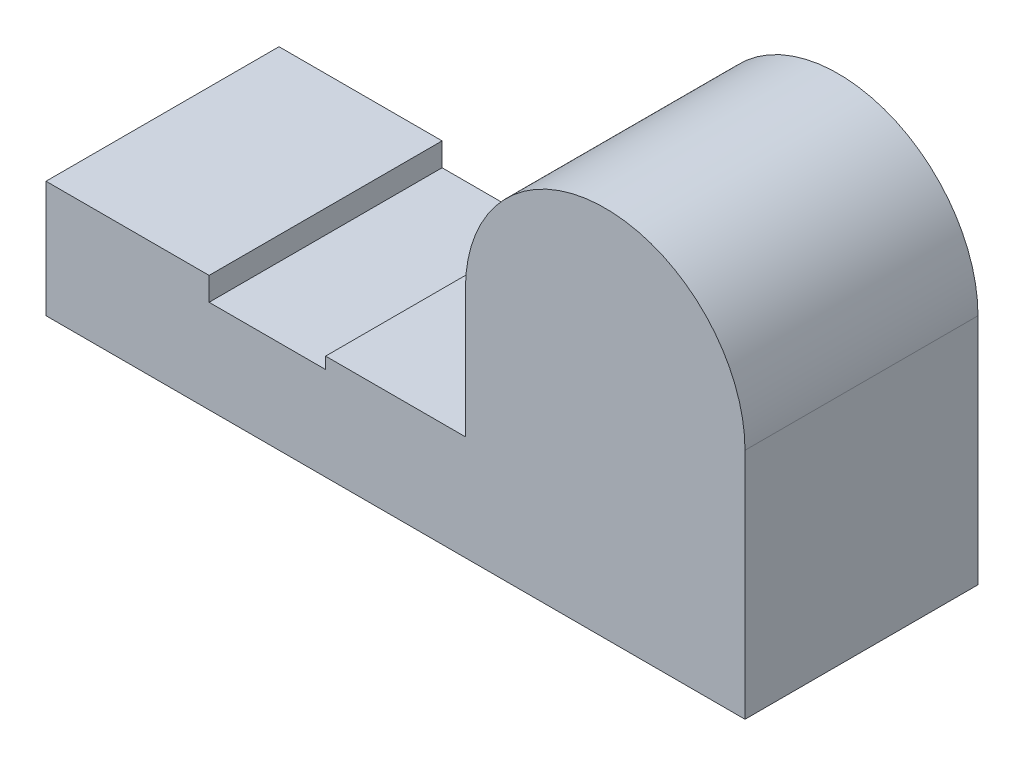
ISO-10303-21;
HEADER;
FILE_DESCRIPTION(('STEP AP214'),'2;1');
FILE_NAME('part.step','',(''),(''),'','','');
FILE_SCHEMA(('AUTOMOTIVE_DESIGN { 1 0 10303 214 1 1 1 1 }'));
ENDSEC;
DATA;
#1=APPLICATION_CONTEXT('core data for automotive mechanical design processes');
#2=APPLICATION_PROTOCOL_DEFINITION('international standard','automotive_design',2000,#1);
#3=PRODUCT_CONTEXT('',#1,'mechanical');
#4=PRODUCT('Part','Part','',(#3));
#5=PRODUCT_RELATED_PRODUCT_CATEGORY('part','',(#4));
#6=PRODUCT_DEFINITION_FORMATION('','',#4);
#7=PRODUCT_DEFINITION_CONTEXT('part definition',#1,'design');
#8=PRODUCT_DEFINITION('design','',#6,#7);
#9=PRODUCT_DEFINITION_SHAPE('','',#8);
#10=(LENGTH_UNIT() NAMED_UNIT(*) SI_UNIT(.MILLI.,.METRE.));
#11=(NAMED_UNIT(*) PLANE_ANGLE_UNIT() SI_UNIT($,.RADIAN.));
#12=(NAMED_UNIT(*) SI_UNIT($,.STERADIAN.) SOLID_ANGLE_UNIT());
#13=UNCERTAINTY_MEASURE_WITH_UNIT(LENGTH_MEASURE(1.E-05),#10,'distance_accuracy_value','');
#14=(GEOMETRIC_REPRESENTATION_CONTEXT(3) GLOBAL_UNCERTAINTY_ASSIGNED_CONTEXT((#13)) GLOBAL_UNIT_ASSIGNED_CONTEXT((#10,
#11,#12)) REPRESENTATION_CONTEXT('',''));
#15=CARTESIAN_POINT('',(0.,0.,0.));
#16=DIRECTION('',(0.,0.,1.));
#17=DIRECTION('',(1.,0.,0.));
#18=AXIS2_PLACEMENT_3D('',#15,#16,#17);
#19=CARTESIAN_POINT('',(160.,45.,100.));
#20=DIRECTION('',(1.,0.,0.));
#21=DIRECTION('',(0.,0.,-1.));
#22=AXIS2_PLACEMENT_3D('',#19,#20,#21);
#23=PLANE('',#22);
#24=DIRECTION('',(0.,-1.,0.));
#25=VECTOR('',#24,1.);
#26=CARTESIAN_POINT('',(160.,45.,0.));
#27=LINE('',#26,#25);
#28=CARTESIAN_POINT('',(160.,45.,0.));
#29=VERTEX_POINT('',#28);
#30=CARTESIAN_POINT('',(160.,40.,0.));
#31=VERTEX_POINT('',#30);
#32=EDGE_CURVE('E140',#29,#31,#27,.T.);
#33=ORIENTED_EDGE('',*,*,#32,.T.);
#34=DIRECTION('',(0.,0.,-1.));
#35=VECTOR('',#34,1.);
#36=CARTESIAN_POINT('',(160.,40.,100.));
#37=LINE('',#36,#35);
#38=CARTESIAN_POINT('',(160.,40.,100.));
#39=VERTEX_POINT('',#38);
#40=EDGE_CURVE('E11',#39,#31,#37,.T.);
#41=ORIENTED_EDGE('',*,*,#40,.F.);
#42=DIRECTION('',(0.,-1.,0.));
#43=VECTOR('',#42,1.);
#44=CARTESIAN_POINT('',(160.,45.,100.));
#45=LINE('',#44,#43);
#46=CARTESIAN_POINT('',(160.,45.,100.));
#47=VERTEX_POINT('',#46);
#48=EDGE_CURVE('E158',#47,#39,#45,.T.);
#49=ORIENTED_EDGE('',*,*,#48,.F.);
#50=DIRECTION('',(0.,0.,-1.));
#51=VECTOR('',#50,1.);
#52=CARTESIAN_POINT('',(160.,45.,100.));
#53=LINE('',#52,#51);
#54=EDGE_CURVE('E136',#47,#29,#53,.T.);
#55=ORIENTED_EDGE('',*,*,#54,.T.);
#56=EDGE_LOOP('',(#33,#41,#49,#55));
#57=FACE_BOUND('',#56,.T.);
#58=ADVANCED_FACE('F32',(#57),#23,.F.);
#59=CARTESIAN_POINT('',(160.,40.,100.));
#60=DIRECTION('',(0.,-1.,0.));
#61=DIRECTION('',(1.,0.,0.));
#62=AXIS2_PLACEMENT_3D('',#59,#60,#61);
#63=PLANE('',#62);
#64=DIRECTION('',(-1.,0.,0.));
#65=VECTOR('',#64,1.);
#66=CARTESIAN_POINT('',(160.,40.,0.));
#67=LINE('',#66,#65);
#68=CARTESIAN_POINT('',(110.,40.,0.));
#69=VERTEX_POINT('',#68);
#70=EDGE_CURVE('E143',#31,#69,#67,.T.);
#71=ORIENTED_EDGE('',*,*,#70,.T.);
#72=DIRECTION('',(0.,0.,-1.));
#73=VECTOR('',#72,1.);
#74=CARTESIAN_POINT('',(110.,40.,100.));
#75=LINE('',#74,#73);
#76=CARTESIAN_POINT('',(110.,40.,100.));
#77=VERTEX_POINT('',#76);
#78=EDGE_CURVE('E40',#77,#69,#75,.T.);
#79=ORIENTED_EDGE('',*,*,#78,.F.);
#80=DIRECTION('',(-1.,0.,0.));
#81=VECTOR('',#80,1.);
#82=CARTESIAN_POINT('',(160.,40.,100.));
#83=LINE('',#82,#81);
#84=EDGE_CURVE('E97',#39,#77,#83,.T.);
#85=ORIENTED_EDGE('',*,*,#84,.F.);
#86=ORIENTED_EDGE('',*,*,#40,.T.);
#87=EDGE_LOOP('',(#71,#79,#85,#86));
#88=FACE_BOUND('',#87,.T.);
#89=ADVANCED_FACE('F207',(#88),#63,.F.);
#90=CARTESIAN_POINT('',(110.,40.,100.));
#91=DIRECTION('',(-1.,0.,0.));
#92=DIRECTION('',(0.,0.,1.));
#93=AXIS2_PLACEMENT_3D('',#90,#91,#92);
#94=PLANE('',#93);
#95=DIRECTION('',(0.,1.,0.));
#96=VECTOR('',#95,1.);
#97=CARTESIAN_POINT('',(110.,40.,0.));
#98=LINE('',#97,#96);
#99=CARTESIAN_POINT('',(110.,50.,0.));
#100=VERTEX_POINT('',#99);
#101=EDGE_CURVE('E145',#69,#100,#98,.T.);
#102=ORIENTED_EDGE('',*,*,#101,.T.);
#103=DIRECTION('',(0.,0.,-1.));
#104=VECTOR('',#103,1.);
#105=CARTESIAN_POINT('',(110.,50.,100.));
#106=LINE('',#105,#104);
#107=CARTESIAN_POINT('',(110.,50.,100.));
#108=VERTEX_POINT('',#107);
#109=EDGE_CURVE('E171',#108,#100,#106,.T.);
#110=ORIENTED_EDGE('',*,*,#109,.F.);
#111=DIRECTION('',(0.,1.,0.));
#112=VECTOR('',#111,1.);
#113=CARTESIAN_POINT('',(110.,40.,100.));
#114=LINE('',#113,#112);
#115=EDGE_CURVE('E179',#77,#108,#114,.T.);
#116=ORIENTED_EDGE('',*,*,#115,.F.);
#117=ORIENTED_EDGE('',*,*,#78,.T.);
#118=EDGE_LOOP('',(#102,#110,#116,#117));
#119=FACE_BOUND('',#118,.T.);
#120=ADVANCED_FACE('F177',(#119),#94,.F.);
#121=CARTESIAN_POINT('',(110.,50.,100.));
#122=DIRECTION('',(0.,-1.,0.));
#123=DIRECTION('',(0.,0.,-1.));
#124=AXIS2_PLACEMENT_3D('',#121,#122,#123);
#125=PLANE('',#124);
#126=DIRECTION('',(-1.,0.,0.));
#127=VECTOR('',#126,1.);
#128=CARTESIAN_POINT('',(110.,50.,0.));
#129=LINE('',#128,#127);
#130=CARTESIAN_POINT('',(40.,50.,0.));
#131=VERTEX_POINT('',#130);
#132=EDGE_CURVE('E147',#100,#131,#129,.T.);
#133=ORIENTED_EDGE('',*,*,#132,.T.);
#134=DIRECTION('',(0.,0.,-1.));
#135=VECTOR('',#134,1.);
#136=CARTESIAN_POINT('',(40.,50.,100.));
#137=LINE('',#136,#135);
#138=CARTESIAN_POINT('',(40.,50.,100.));
#139=VERTEX_POINT('',#138);
#140=EDGE_CURVE('E168',#139,#131,#137,.T.);
#141=ORIENTED_EDGE('',*,*,#140,.F.);
#142=DIRECTION('',(-1.,0.,0.));
#143=VECTOR('',#142,1.);
#144=CARTESIAN_POINT('',(110.,50.,100.));
#145=LINE('',#144,#143);
#146=EDGE_CURVE('E197',#108,#139,#145,.T.);
#147=ORIENTED_EDGE('',*,*,#146,.F.);
#148=ORIENTED_EDGE('',*,*,#109,.T.);
#149=EDGE_LOOP('',(#133,#141,#147,#148));
#150=FACE_BOUND('',#149,.T.);
#151=ADVANCED_FACE('F188',(#150),#125,.F.);
#152=CARTESIAN_POINT('',(40.,50.,100.));
#153=DIRECTION('',(1.,0.,0.));
#154=DIRECTION('',(0.,1.,0.));
#155=AXIS2_PLACEMENT_3D('',#152,#153,#154);
#156=PLANE('',#155);
#157=DIRECTION('',(0.,-1.,0.));
#158=VECTOR('',#157,1.);
#159=CARTESIAN_POINT('',(40.,50.,0.));
#160=LINE('',#159,#158);
#161=CARTESIAN_POINT('',(40.,0.,0.));
#162=VERTEX_POINT('',#161);
#163=EDGE_CURVE('E149',#131,#162,#160,.T.);
#164=ORIENTED_EDGE('',*,*,#163,.T.);
#165=DIRECTION('',(0.,0.,-1.));
#166=VECTOR('',#165,1.);
#167=CARTESIAN_POINT('',(40.,0.,100.));
#168=LINE('',#167,#166);
#169=CARTESIAN_POINT('',(40.,0.,100.));
#170=VERTEX_POINT('',#169);
#171=EDGE_CURVE('E165',#170,#162,#168,.T.);
#172=ORIENTED_EDGE('',*,*,#171,.F.);
#173=DIRECTION('',(0.,-1.,0.));
#174=VECTOR('',#173,1.);
#175=CARTESIAN_POINT('',(40.,50.,100.));
#176=LINE('',#175,#174);
#177=EDGE_CURVE('E194',#139,#170,#176,.T.);
#178=ORIENTED_EDGE('',*,*,#177,.F.);
#179=ORIENTED_EDGE('',*,*,#140,.T.);
#180=EDGE_LOOP('',(#164,#172,#178,#179));
#181=FACE_BOUND('',#180,.T.);
#182=ADVANCED_FACE('F192',(#181),#156,.F.);
#183=CARTESIAN_POINT('',(40.,0.,100.));
#184=DIRECTION('',(0.,1.,0.));
#185=DIRECTION('',(0.,0.,1.));
#186=AXIS2_PLACEMENT_3D('',#183,#184,#185);
#187=PLANE('',#186);
#188=DIRECTION('',(1.,0.,0.));
#189=VECTOR('',#188,1.);
#190=CARTESIAN_POINT('',(40.,0.,0.));
#191=LINE('',#190,#189);
#192=CARTESIAN_POINT('',(340.,0.,0.));
#193=VERTEX_POINT('',#192);
#194=EDGE_CURVE('E151',#162,#193,#191,.T.);
#195=ORIENTED_EDGE('',*,*,#194,.T.);
#196=DIRECTION('',(0.,0.,-1.));
#197=VECTOR('',#196,1.);
#198=CARTESIAN_POINT('',(340.,0.,100.));
#199=LINE('',#198,#197);
#200=CARTESIAN_POINT('',(340.,0.,100.));
#201=VERTEX_POINT('',#200);
#202=EDGE_CURVE('E162',#201,#193,#199,.T.);
#203=ORIENTED_EDGE('',*,*,#202,.F.);
#204=DIRECTION('',(1.,0.,0.));
#205=VECTOR('',#204,1.);
#206=CARTESIAN_POINT('',(40.,0.,100.));
#207=LINE('',#206,#205);
#208=EDGE_CURVE('E196',#170,#201,#207,.T.);
#209=ORIENTED_EDGE('',*,*,#208,.F.);
#210=ORIENTED_EDGE('',*,*,#171,.T.);
#211=EDGE_LOOP('',(#195,#203,#209,#210));
#212=FACE_BOUND('',#211,.T.);
#213=ADVANCED_FACE('F219',(#212),#187,.F.);
#214=CARTESIAN_POINT('',(340.,0.,100.));
#215=DIRECTION('',(-1.,0.,0.));
#216=DIRECTION('',(0.,0.,1.));
#217=AXIS2_PLACEMENT_3D('',#214,#215,#216);
#218=PLANE('',#217);
#219=DIRECTION('',(0.,1.,0.));
#220=VECTOR('',#219,1.);
#221=CARTESIAN_POINT('',(340.,0.,0.));
#222=LINE('',#221,#220);
#223=CARTESIAN_POINT('',(340.,100.,0.));
#224=VERTEX_POINT('',#223);
#225=EDGE_CURVE('E153',#193,#224,#222,.T.);
#226=ORIENTED_EDGE('',*,*,#225,.T.);
#227=DIRECTION('',(0.,0.,-1.));
#228=VECTOR('',#227,1.);
#229=CARTESIAN_POINT('',(340.,100.,100.));
#230=LINE('',#229,#228);
#231=CARTESIAN_POINT('',(340.,100.,100.));
#232=VERTEX_POINT('',#231);
#233=EDGE_CURVE('E131',#232,#224,#230,.T.);
#234=ORIENTED_EDGE('',*,*,#233,.F.);
#235=DIRECTION('',(0.,1.,0.));
#236=VECTOR('',#235,1.);
#237=CARTESIAN_POINT('',(340.,0.,100.));
#238=LINE('',#237,#236);
#239=EDGE_CURVE('E122',#201,#232,#238,.T.);
#240=ORIENTED_EDGE('',*,*,#239,.F.);
#241=ORIENTED_EDGE('',*,*,#202,.T.);
#242=EDGE_LOOP('',(#226,#234,#240,#241));
#243=FACE_BOUND('',#242,.T.);
#244=ADVANCED_FACE('F222',(#243),#218,.F.);
#245=CARTESIAN_POINT('',(280.,100.,100.));
#246=DIRECTION('',(0.,0.,-1.));
#247=DIRECTION('',(-1.,0.,0.));
#248=AXIS2_PLACEMENT_3D('',#245,#246,#247);
#249=CYLINDRICAL_SURFACE('',#248,59.9999999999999);
#250=CARTESIAN_POINT('',(280.,100.,0.));
#251=DIRECTION('',(0.,0.,1.));
#252=DIRECTION('',(1.,0.,0.));
#253=AXIS2_PLACEMENT_3D('',#250,#251,#252);
#254=CIRCLE('',#253,59.9999999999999);
#255=CARTESIAN_POINT('',(220.,100.,0.));
#256=VERTEX_POINT('',#255);
#257=EDGE_CURVE('E130',#224,#256,#254,.T.);
#258=ORIENTED_EDGE('',*,*,#257,.T.);
#259=DIRECTION('',(0.,0.,-1.));
#260=VECTOR('',#259,1.);
#261=CARTESIAN_POINT('',(220.,100.,100.));
#262=LINE('',#261,#260);
#263=CARTESIAN_POINT('',(220.,100.,100.));
#264=VERTEX_POINT('',#263);
#265=EDGE_CURVE('E127',#264,#256,#262,.T.);
#266=ORIENTED_EDGE('',*,*,#265,.F.);
#267=CARTESIAN_POINT('',(280.,100.,100.));
#268=DIRECTION('',(0.,0.,1.));
#269=DIRECTION('',(1.,0.,0.));
#270=AXIS2_PLACEMENT_3D('',#267,#268,#269);
#271=CIRCLE('',#270,59.9999999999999);
#272=EDGE_CURVE('E116',#232,#264,#271,.T.);
#273=ORIENTED_EDGE('',*,*,#272,.F.);
#274=ORIENTED_EDGE('',*,*,#233,.T.);
#275=EDGE_LOOP('',(#258,#266,#273,#274));
#276=FACE_BOUND('',#275,.T.);
#277=ADVANCED_FACE('F128',(#276),#249,.T.);
#278=CARTESIAN_POINT('',(220.,100.,100.));
#279=DIRECTION('',(1.,0.,0.));
#280=DIRECTION('',(0.,0.,-1.));
#281=AXIS2_PLACEMENT_3D('',#278,#279,#280);
#282=PLANE('',#281);
#283=DIRECTION('',(0.,-1.,0.));
#284=VECTOR('',#283,1.);
#285=CARTESIAN_POINT('',(220.,100.,0.));
#286=LINE('',#285,#284);
#287=CARTESIAN_POINT('',(220.,45.,0.));
#288=VERTEX_POINT('',#287);
#289=EDGE_CURVE('E83',#256,#288,#286,.T.);
#290=ORIENTED_EDGE('',*,*,#289,.T.);
#291=DIRECTION('',(0.,0.,-1.));
#292=VECTOR('',#291,1.);
#293=CARTESIAN_POINT('',(220.,45.,100.));
#294=LINE('',#293,#292);
#295=CARTESIAN_POINT('',(220.,45.,100.));
#296=VERTEX_POINT('',#295);
#297=EDGE_CURVE('E132',#296,#288,#294,.T.);
#298=ORIENTED_EDGE('',*,*,#297,.F.);
#299=DIRECTION('',(0.,-1.,0.));
#300=VECTOR('',#299,1.);
#301=CARTESIAN_POINT('',(220.,100.,100.));
#302=LINE('',#301,#300);
#303=EDGE_CURVE('E120',#264,#296,#302,.T.);
#304=ORIENTED_EDGE('',*,*,#303,.F.);
#305=ORIENTED_EDGE('',*,*,#265,.T.);
#306=EDGE_LOOP('',(#290,#298,#304,#305));
#307=FACE_BOUND('',#306,.T.);
#308=ADVANCED_FACE('F134',(#307),#282,.F.);
#309=CARTESIAN_POINT('',(220.,45.,100.));
#310=DIRECTION('',(0.,-1.,0.));
#311=DIRECTION('',(0.,0.,-1.));
#312=AXIS2_PLACEMENT_3D('',#309,#310,#311);
#313=PLANE('',#312);
#314=DIRECTION('',(-1.,0.,0.));
#315=VECTOR('',#314,1.);
#316=CARTESIAN_POINT('',(220.,45.,0.));
#317=LINE('',#316,#315);
#318=EDGE_CURVE('E89',#288,#29,#317,.T.);
#319=ORIENTED_EDGE('',*,*,#318,.T.);
#320=ORIENTED_EDGE('',*,*,#54,.F.);
#321=DIRECTION('',(-1.,0.,0.));
#322=VECTOR('',#321,1.);
#323=CARTESIAN_POINT('',(220.,45.,100.));
#324=LINE('',#323,#322);
#325=EDGE_CURVE('E48',#296,#47,#324,.T.);
#326=ORIENTED_EDGE('',*,*,#325,.F.);
#327=ORIENTED_EDGE('',*,*,#297,.T.);
#328=EDGE_LOOP('',(#319,#320,#326,#327));
#329=FACE_BOUND('',#328,.T.);
#330=ADVANCED_FACE('F231',(#329),#313,.F.);
#331=CARTESIAN_POINT('',(280.,100.,100.));
#332=DIRECTION('',(0.,0.,1.));
#333=DIRECTION('',(1.,0.,0.));
#334=AXIS2_PLACEMENT_3D('',#331,#332,#333);
#335=PLANE('',#334);
#336=ORIENTED_EDGE('',*,*,#48,.T.);
#337=ORIENTED_EDGE('',*,*,#84,.T.);
#338=ORIENTED_EDGE('',*,*,#115,.T.);
#339=ORIENTED_EDGE('',*,*,#146,.T.);
#340=ORIENTED_EDGE('',*,*,#177,.T.);
#341=ORIENTED_EDGE('',*,*,#208,.T.);
#342=ORIENTED_EDGE('',*,*,#239,.T.);
#343=ORIENTED_EDGE('',*,*,#272,.T.);
#344=ORIENTED_EDGE('',*,*,#303,.T.);
#345=ORIENTED_EDGE('',*,*,#325,.T.);
#346=EDGE_LOOP('',(#336,#337,#338,#339,#340,#341,#342,#343,#344,#345));
#347=FACE_BOUND('',#346,.T.);
#348=ADVANCED_FACE('F118',(#347),#335,.T.);
#349=CARTESIAN_POINT('',(280.,100.,0.));
#350=DIRECTION('',(0.,0.,1.));
#351=DIRECTION('',(1.,0.,0.));
#352=AXIS2_PLACEMENT_3D('',#349,#350,#351);
#353=PLANE('',#352);
#354=ORIENTED_EDGE('',*,*,#32,.F.);
#355=ORIENTED_EDGE('',*,*,#318,.F.);
#356=ORIENTED_EDGE('',*,*,#289,.F.);
#357=ORIENTED_EDGE('',*,*,#257,.F.);
#358=ORIENTED_EDGE('',*,*,#225,.F.);
#359=ORIENTED_EDGE('',*,*,#194,.F.);
#360=ORIENTED_EDGE('',*,*,#163,.F.);
#361=ORIENTED_EDGE('',*,*,#132,.F.);
#362=ORIENTED_EDGE('',*,*,#101,.F.);
#363=ORIENTED_EDGE('',*,*,#70,.F.);
#364=EDGE_LOOP('',(#354,#355,#356,#357,#358,#359,#360,#361,#362,#363));
#365=FACE_BOUND('',#364,.T.);
#366=ADVANCED_FACE('F183',(#365),#353,.F.);
#367=CLOSED_SHELL('',(#58,#89,#120,#151,#182,#213,#244,#277,#308,#330,#348,#366));
#368=MANIFOLD_SOLID_BREP('B2',#367);
#369=ADVANCED_BREP_SHAPE_REPRESENTATION('',(#18,#368),#14);
#370=SHAPE_DEFINITION_REPRESENTATION(#9,#369);
ENDSEC;
END-ISO-10303-21;
